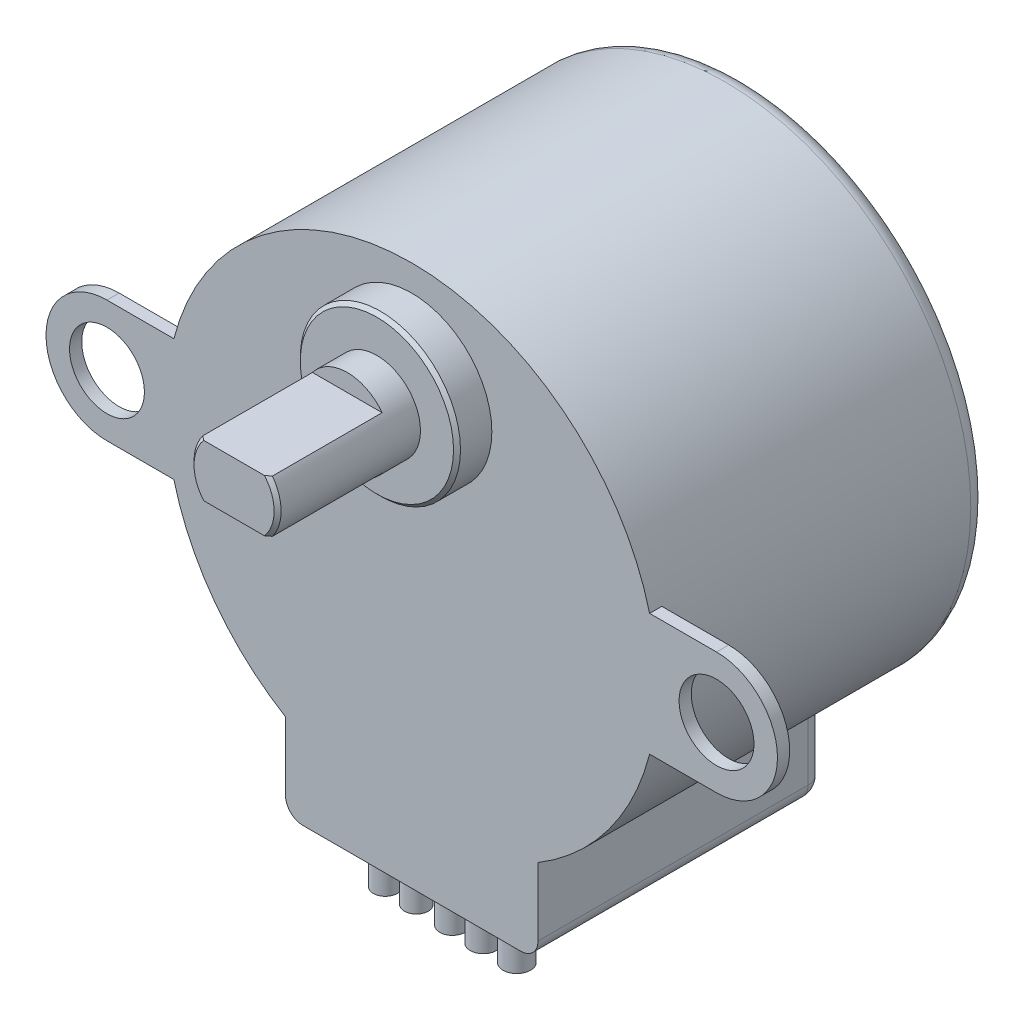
ISO-10303-21;
HEADER;
FILE_DESCRIPTION(('STEP AP214'),'2;1');
FILE_NAME('part.step','',(''),(''),'','','');
FILE_SCHEMA(('AUTOMOTIVE_DESIGN { 1 0 10303 214 1 1 1 1 }'));
ENDSEC;
DATA;
#1=APPLICATION_CONTEXT('core data for automotive mechanical design processes');
#2=APPLICATION_PROTOCOL_DEFINITION('international standard','automotive_design',2000,#1);
#3=PRODUCT_CONTEXT('',#1,'mechanical');
#4=PRODUCT('Part','Part','',(#3));
#5=PRODUCT_RELATED_PRODUCT_CATEGORY('part','',(#4));
#6=PRODUCT_DEFINITION_FORMATION('','',#4);
#7=PRODUCT_DEFINITION_CONTEXT('part definition',#1,'design');
#8=PRODUCT_DEFINITION('design','',#6,#7);
#9=PRODUCT_DEFINITION_SHAPE('','',#8);
#10=(LENGTH_UNIT() NAMED_UNIT(*) SI_UNIT(.MILLI.,.METRE.));
#11=(NAMED_UNIT(*) PLANE_ANGLE_UNIT() SI_UNIT($,.RADIAN.));
#12=(NAMED_UNIT(*) SI_UNIT($,.STERADIAN.) SOLID_ANGLE_UNIT());
#13=UNCERTAINTY_MEASURE_WITH_UNIT(LENGTH_MEASURE(1.E-05),#10,'distance_accuracy_value','');
#14=(GEOMETRIC_REPRESENTATION_CONTEXT(3) GLOBAL_UNCERTAINTY_ASSIGNED_CONTEXT((#13)) GLOBAL_UNIT_ASSIGNED_CONTEXT((#10,
#11,#12)) REPRESENTATION_CONTEXT('',''));
#15=CARTESIAN_POINT('',(0.,0.,0.));
#16=DIRECTION('',(0.,0.,1.));
#17=DIRECTION('',(1.,0.,0.));
#18=AXIS2_PLACEMENT_3D('',#15,#16,#17);
#19=CARTESIAN_POINT('',(0.,0.,19.));
#20=DIRECTION('',(0.,0.,-1.));
#21=DIRECTION('',(-1.,0.,0.));
#22=AXIS2_PLACEMENT_3D('',#19,#20,#21);
#23=CYLINDRICAL_SURFACE('',#22,14.1);
#24=CARTESIAN_POINT('',(0.,0.,19.));
#25=DIRECTION('',(0.,0.,1.));
#26=DIRECTION('',(1.,0.,0.));
#27=AXIS2_PLACEMENT_3D('',#24,#25,#26);
#28=CIRCLE('',#27,14.1);
#29=CARTESIAN_POINT('',(7.25,-12.0932832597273,19.));
#30=VERTEX_POINT('',#29);
#31=CARTESIAN_POINT('',(13.6586968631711,-3.5,19.));
#32=VERTEX_POINT('',#31);
#33=EDGE_CURVE('E210',#30,#32,#28,.T.);
#34=ORIENTED_EDGE('',*,*,#33,.F.);
#35=DIRECTION('',(0.,0.,1.));
#36=VECTOR('',#35,1.);
#37=CARTESIAN_POINT('',(7.25,-12.0932832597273,2.5));
#38=LINE('',#37,#36);
#39=CARTESIAN_POINT('',(7.25,-12.0932832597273,3.5));
#40=VERTEX_POINT('',#39);
#41=EDGE_CURVE('E191',#40,#30,#38,.T.);
#42=ORIENTED_EDGE('',*,*,#41,.F.);
#43=CARTESIAN_POINT('',(7.25,-12.0932832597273,3.5));
#44=CARTESIAN_POINT('',(7.25000168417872,-12.0932817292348,3.47459911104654));
#45=CARTESIAN_POINT('',(7.24903146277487,-12.0938639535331,3.44921177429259));
#46=CARTESIAN_POINT('',(7.24517330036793,-12.0961759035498,3.39864565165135));
#47=CARTESIAN_POINT('',(7.24228611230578,-12.0979051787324,3.3734667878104));
#48=CARTESIAN_POINT('',(7.23083007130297,-12.1047585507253,3.29876541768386));
#49=CARTESIAN_POINT('',(7.21946606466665,-12.1115486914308,3.24978931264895));
#50=CARTESIAN_POINT('',(7.18986225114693,-12.1291455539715,3.15484074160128));
#51=CARTESIAN_POINT('',(7.17163025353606,-12.1399477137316,3.10886493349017));
#52=CARTESIAN_POINT('',(7.1290701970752,-12.1649893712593,3.02080300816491));
#53=CARTESIAN_POINT('',(7.10473597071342,-12.1792323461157,2.9787208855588));
#54=CARTESIAN_POINT('',(7.04923346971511,-12.2114452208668,2.89682658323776));
#55=CARTESIAN_POINT('',(7.01774282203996,-12.2295874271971,2.85730197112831));
#56=CARTESIAN_POINT('',(6.94991243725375,-12.2682615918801,2.78402660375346));
#57=CARTESIAN_POINT('',(6.91357125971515,-12.2887942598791,2.75027757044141));
#58=CARTESIAN_POINT('',(6.83178892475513,-12.3344692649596,2.68475548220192));
#59=CARTESIAN_POINT('',(6.78578144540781,-12.3598598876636,2.65386201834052));
#60=CARTESIAN_POINT('',(6.6899080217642,-12.4120151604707,2.60027714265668));
#61=CARTESIAN_POINT('',(6.64003921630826,-12.4387808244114,2.5775918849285));
#62=CARTESIAN_POINT('',(6.53449257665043,-12.4945647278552,2.53958647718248));
#63=CARTESIAN_POINT('',(6.47864575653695,-12.5236216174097,2.52479145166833));
#64=CARTESIAN_POINT('',(6.36526848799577,-12.5816341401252,2.5049996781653));
#65=CARTESIAN_POINT('',(6.30773988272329,-12.6105898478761,2.49999258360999));
#66=CARTESIAN_POINT('',(6.25,-12.6391257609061,2.5));
#67=B_SPLINE_CURVE_WITH_KNOTS('',3,(#43,#44,#45,#46,#47,#48,#49,#50,#51,#52,#53,#54,#55,#56,#57,
#58,#59,#60,#61,#62,#63,#64,#65,#66),.UNSPECIFIED.,.F.,.F.,(4,2,2,2,2,2,2,2,2,2,2,4),(0.,
0.0761512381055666,0.152272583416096,0.303660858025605,0.454877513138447,0.606247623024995,
0.766697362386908,0.927194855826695,1.1093270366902,1.29159548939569,1.48482806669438,
1.67785627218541),.UNSPECIFIED.);
#68=CARTESIAN_POINT('',(6.25,-12.6391257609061,2.5));
#69=VERTEX_POINT('',#68);
#70=EDGE_CURVE('E45',#40,#69,#67,.T.);
#71=ORIENTED_EDGE('',*,*,#70,.T.);
#72=CARTESIAN_POINT('',(0.,0.,2.5));
#73=DIRECTION('',(0.,0.,-1.));
#74=DIRECTION('',(1.,0.,0.));
#75=AXIS2_PLACEMENT_3D('',#72,#73,#74);
#76=CIRCLE('',#75,14.1);
#77=CARTESIAN_POINT('',(-6.25,-12.6391257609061,2.5));
#78=VERTEX_POINT('',#77);
#79=EDGE_CURVE('E192',#69,#78,#76,.T.);
#80=ORIENTED_EDGE('',*,*,#79,.T.);
#81=CARTESIAN_POINT('',(-6.25,-12.6391257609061,2.5));
#82=CARTESIAN_POINT('',(-6.31273446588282,-12.6081259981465,2.49999247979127));
#83=CARTESIAN_POINT('',(-6.3752117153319,-12.5766285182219,2.50590226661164));
#84=CARTESIAN_POINT('',(-6.49810654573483,-12.5135623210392,2.52924825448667));
#85=CARTESIAN_POINT('',(-6.55851957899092,-12.4819935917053,2.54670837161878));
#86=CARTESIAN_POINT('',(-6.67550796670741,-12.4198239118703,2.59286061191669));
#87=CARTESIAN_POINT('',(-6.73208054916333,-12.3892236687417,2.6215607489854));
#88=CARTESIAN_POINT('',(-6.83956541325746,-12.3302105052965,2.68977855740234));
#89=CARTESIAN_POINT('',(-6.89048096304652,-12.3017963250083,2.72928993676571));
#90=CARTESIAN_POINT('',(-6.98267203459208,-12.2496930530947,2.8165922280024));
#91=CARTESIAN_POINT('',(-7.02426990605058,-12.2258524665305,2.86394966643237));
#92=CARTESIAN_POINT('',(-7.09855678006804,-12.1828706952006,2.96710484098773));
#93=CARTESIAN_POINT('',(-7.13125204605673,-12.1637262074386,3.02289659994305));
#94=CARTESIAN_POINT('',(-7.18216086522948,-12.1337268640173,3.13353777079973));
#95=CARTESIAN_POINT('',(-7.2017018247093,-12.12211937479,3.18757282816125));
#96=CARTESIAN_POINT('',(-7.23126870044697,-12.1045056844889,3.29898284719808));
#97=CARTESIAN_POINT('',(-7.24132376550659,-12.0984823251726,3.35634699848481));
#98=CARTESIAN_POINT('',(-7.24754151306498,-12.0947567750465,3.42845423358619));
#99=CARTESIAN_POINT('',(-7.24846346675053,-12.0942042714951,3.44275170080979));
#100=CARTESIAN_POINT('',(-7.24969164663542,-12.0934681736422,3.47136380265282));
#101=CARTESIAN_POINT('',(-7.24999867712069,-12.093284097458,3.48567839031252));
#102=CARTESIAN_POINT('',(-7.25,-12.0932832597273,3.5));
#103=B_SPLINE_CURVE_WITH_KNOTS('',3,(#81,#82,#83,#84,#85,#86,#87,#88,#89,#90,#91,#92,#93,#94,
#95,#96,#97,#98,#99,#100,#101,#102),.UNSPECIFIED.,.F.,.F.,(4,2,2,2,2,2,2,2,2,2,4),(0.,
0.209670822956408,0.419777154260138,0.630033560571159,0.840167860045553,1.04118736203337,
1.24206506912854,1.41691801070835,1.59123188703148,1.63423450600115,1.67718084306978),.UNSPECIFIED.);
#104=CARTESIAN_POINT('',(-7.25,-12.0932832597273,3.5));
#105=VERTEX_POINT('',#104);
#106=EDGE_CURVE('E11',#78,#105,#103,.T.);
#107=ORIENTED_EDGE('',*,*,#106,.T.);
#108=DIRECTION('',(0.,0.,1.));
#109=VECTOR('',#108,1.);
#110=CARTESIAN_POINT('',(-7.25,-12.0932832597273,2.5));
#111=LINE('',#110,#109);
#112=CARTESIAN_POINT('',(-7.25,-12.0932832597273,19.));
#113=VERTEX_POINT('',#112);
#114=EDGE_CURVE('E184',#105,#113,#111,.T.);
#115=ORIENTED_EDGE('',*,*,#114,.T.);
#116=CARTESIAN_POINT('',(-13.6586968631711,-3.5,19.));
#117=VERTEX_POINT('',#116);
#118=EDGE_CURVE('E190',#117,#113,#28,.T.);
#119=ORIENTED_EDGE('',*,*,#118,.F.);
#120=DIRECTION('',(0.,0.,-1.));
#121=VECTOR('',#120,1.);
#122=CARTESIAN_POINT('',(-13.6586968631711,-3.5,19.));
#123=LINE('',#122,#121);
#124=CARTESIAN_POINT('',(-13.6586968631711,-3.5,18.3));
#125=VERTEX_POINT('',#124);
#126=EDGE_CURVE('E479',#117,#125,#123,.T.);
#127=ORIENTED_EDGE('',*,*,#126,.T.);
#128=CARTESIAN_POINT('',(0.,0.,18.3));
#129=DIRECTION('',(0.,0.,1.));
#130=DIRECTION('',(1.,0.,0.));
#131=AXIS2_PLACEMENT_3D('',#128,#129,#130);
#132=CIRCLE('',#131,14.1);
#133=CARTESIAN_POINT('',(-13.6586968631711,3.5,18.3));
#134=VERTEX_POINT('',#133);
#135=EDGE_CURVE('E219',#134,#125,#132,.T.);
#136=ORIENTED_EDGE('',*,*,#135,.F.);
#137=DIRECTION('',(0.,0.,-1.));
#138=VECTOR('',#137,1.);
#139=CARTESIAN_POINT('',(-13.6586968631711,3.5,19.));
#140=LINE('',#139,#138);
#141=CARTESIAN_POINT('',(-13.6586968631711,3.5,19.));
#142=VERTEX_POINT('',#141);
#143=EDGE_CURVE('E480',#134,#142,#140,.F.);
#144=ORIENTED_EDGE('',*,*,#143,.T.);
#145=CARTESIAN_POINT('',(13.6586968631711,3.5,19.));
#146=VERTEX_POINT('',#145);
#147=EDGE_CURVE('E209',#146,#142,#28,.T.);
#148=ORIENTED_EDGE('',*,*,#147,.F.);
#149=DIRECTION('',(0.,0.,-1.));
#150=VECTOR('',#149,1.);
#151=CARTESIAN_POINT('',(13.6586968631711,3.5,19.));
#152=LINE('',#151,#150);
#153=CARTESIAN_POINT('',(13.6586968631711,3.5,18.3));
#154=VERTEX_POINT('',#153);
#155=EDGE_CURVE('E214',#146,#154,#152,.T.);
#156=ORIENTED_EDGE('',*,*,#155,.T.);
#157=CARTESIAN_POINT('',(13.6586968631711,-3.5,18.3));
#158=VERTEX_POINT('',#157);
#159=EDGE_CURVE('E213',#158,#154,#132,.T.);
#160=ORIENTED_EDGE('',*,*,#159,.F.);
#161=DIRECTION('',(0.,0.,-1.));
#162=VECTOR('',#161,1.);
#163=CARTESIAN_POINT('',(13.6586968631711,-3.5,19.));
#164=LINE('',#163,#162);
#165=EDGE_CURVE('E470',#158,#32,#164,.F.);
#166=ORIENTED_EDGE('',*,*,#165,.T.);
#167=EDGE_LOOP('',(#34,#42,#71,#80,#107,#115,#119,#127,#136,#144,#148,#156,#160,#166));
#168=FACE_BOUND('',#167,.T.);
#169=CARTESIAN_POINT('',(0.,0.,1.));
#170=DIRECTION('',(0.,0.,1.));
#171=DIRECTION('',(1.,0.,0.));
#172=AXIS2_PLACEMENT_3D('',#169,#170,#171);
#173=CIRCLE('',#172,14.1);
#174=CARTESIAN_POINT('',(14.1,0.,1.));
#175=VERTEX_POINT('',#174);
#176=EDGE_CURVE('E220',#175,#175,#173,.T.);
#177=ORIENTED_EDGE('',*,*,#176,.T.);
#178=EDGE_LOOP('',(#177));
#179=FACE_BOUND('',#178,.T.);
#180=ADVANCED_FACE('F35',(#168,#179),#23,.T.);
#181=CARTESIAN_POINT('',(0.,0.,19.));
#182=DIRECTION('',(0.,0.,1.));
#183=DIRECTION('',(1.,0.,0.));
#184=AXIS2_PLACEMENT_3D('',#181,#182,#183);
#185=PLANE('',#184);
#186=CARTESIAN_POINT('',(0.,8.,19.));
#187=DIRECTION('',(0.,0.,1.));
#188=DIRECTION('',(1.,0.,0.));
#189=AXIS2_PLACEMENT_3D('',#186,#187,#188);
#190=CIRCLE('',#189,4.6);
#191=CARTESIAN_POINT('',(4.6,8.,19.));
#192=VERTEX_POINT('',#191);
#193=EDGE_CURVE('E411',#192,#192,#190,.T.);
#194=ORIENTED_EDGE('',*,*,#193,.F.);
#195=EDGE_LOOP('',(#194));
#196=FACE_BOUND('',#195,.T.);
#197=DIRECTION('',(1.,0.,0.));
#198=VECTOR('',#197,1.);
#199=CARTESIAN_POINT('',(-7.25,-17.,19.));
#200=LINE('',#199,#198);
#201=CARTESIAN_POINT('',(-6.25,-17.,19.));
#202=VERTEX_POINT('',#201);
#203=CARTESIAN_POINT('',(6.25,-17.,19.));
#204=VERTEX_POINT('',#203);
#205=EDGE_CURVE('E200',#202,#204,#200,.T.);
#206=ORIENTED_EDGE('',*,*,#205,.T.);
#207=CARTESIAN_POINT('',(6.25,-16.,19.));
#208=DIRECTION('',(0.,0.,1.));
#209=DIRECTION('',(1.,0.,0.));
#210=AXIS2_PLACEMENT_3D('',#207,#208,#209);
#211=CIRCLE('',#210,1.);
#212=CARTESIAN_POINT('',(7.25,-16.,19.));
#213=VERTEX_POINT('',#212);
#214=EDGE_CURVE('E360',#204,#213,#211,.T.);
#215=ORIENTED_EDGE('',*,*,#214,.T.);
#216=DIRECTION('',(0.,1.,0.));
#217=VECTOR('',#216,1.);
#218=CARTESIAN_POINT('',(7.25,-12.0932832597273,19.));
#219=LINE('',#218,#217);
#220=EDGE_CURVE('E379',#213,#30,#219,.T.);
#221=ORIENTED_EDGE('',*,*,#220,.T.);
#222=ORIENTED_EDGE('',*,*,#33,.T.);
#223=DIRECTION('',(1.,0.,0.));
#224=VECTOR('',#223,1.);
#225=CARTESIAN_POINT('',(-17.5,-3.5,19.));
#226=LINE('',#225,#224);
#227=CARTESIAN_POINT('',(17.5,-3.5,19.));
#228=VERTEX_POINT('',#227);
#229=EDGE_CURVE('E460',#32,#228,#226,.T.);
#230=ORIENTED_EDGE('',*,*,#229,.T.);
#231=CARTESIAN_POINT('',(17.5,0.,19.));
#232=DIRECTION('',(0.,0.,1.));
#233=DIRECTION('',(1.,0.,0.));
#234=AXIS2_PLACEMENT_3D('',#231,#232,#233);
#235=CIRCLE('',#234,3.5);
#236=CARTESIAN_POINT('',(17.5,3.5,19.));
#237=VERTEX_POINT('',#236);
#238=EDGE_CURVE('E462',#228,#237,#235,.T.);
#239=ORIENTED_EDGE('',*,*,#238,.T.);
#240=DIRECTION('',(-1.,0.,0.));
#241=VECTOR('',#240,1.);
#242=CARTESIAN_POINT('',(-17.5,3.5,19.));
#243=LINE('',#242,#241);
#244=EDGE_CURVE('E447',#237,#146,#243,.T.);
#245=ORIENTED_EDGE('',*,*,#244,.T.);
#246=ORIENTED_EDGE('',*,*,#147,.T.);
#247=CARTESIAN_POINT('',(-17.5,3.5,19.));
#248=VERTEX_POINT('',#247);
#249=EDGE_CURVE('E465',#142,#248,#243,.T.);
#250=ORIENTED_EDGE('',*,*,#249,.T.);
#251=CARTESIAN_POINT('',(-17.5,0.,19.));
#252=DIRECTION('',(0.,0.,1.));
#253=DIRECTION('',(1.,0.,0.));
#254=AXIS2_PLACEMENT_3D('',#251,#252,#253);
#255=CIRCLE('',#254,3.5);
#256=CARTESIAN_POINT('',(-17.5,-3.5,19.));
#257=VERTEX_POINT('',#256);
#258=EDGE_CURVE('E440',#248,#257,#255,.T.);
#259=ORIENTED_EDGE('',*,*,#258,.T.);
#260=EDGE_CURVE('E207',#257,#117,#226,.T.);
#261=ORIENTED_EDGE('',*,*,#260,.T.);
#262=ORIENTED_EDGE('',*,*,#118,.T.);
#263=DIRECTION('',(0.,-1.,0.));
#264=VECTOR('',#263,1.);
#265=CARTESIAN_POINT('',(-7.25,-12.0932832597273,19.));
#266=LINE('',#265,#264);
#267=CARTESIAN_POINT('',(-7.25,-16.,19.));
#268=VERTEX_POINT('',#267);
#269=EDGE_CURVE('E195',#113,#268,#266,.T.);
#270=ORIENTED_EDGE('',*,*,#269,.T.);
#271=CARTESIAN_POINT('',(-6.25,-16.,19.));
#272=DIRECTION('',(0.,0.,1.));
#273=DIRECTION('',(1.,0.,0.));
#274=AXIS2_PLACEMENT_3D('',#271,#272,#273);
#275=CIRCLE('',#274,1.);
#276=EDGE_CURVE('E356',#268,#202,#275,.T.);
#277=ORIENTED_EDGE('',*,*,#276,.T.);
#278=EDGE_LOOP('',(#206,#215,#221,#222,#230,#239,#245,#246,#250,#259,#261,#262,#270,#277));
#279=FACE_BOUND('',#278,.T.);
#280=CARTESIAN_POINT('',(17.5,0.,19.));
#281=DIRECTION('',(0.,0.,1.));
#282=DIRECTION('',(-1.,0.,0.));
#283=AXIS2_PLACEMENT_3D('',#280,#281,#282);
#284=CIRCLE('',#283,2.15);
#285=CARTESIAN_POINT('',(15.35,0.,19.));
#286=VERTEX_POINT('',#285);
#287=EDGE_CURVE('E430',#286,#286,#284,.T.);
#288=ORIENTED_EDGE('',*,*,#287,.F.);
#289=EDGE_LOOP('',(#288));
#290=FACE_BOUND('',#289,.T.);
#291=CARTESIAN_POINT('',(-17.5,0.,19.));
#292=DIRECTION('',(0.,0.,1.));
#293=DIRECTION('',(1.,0.,0.));
#294=AXIS2_PLACEMENT_3D('',#291,#292,#293);
#295=CIRCLE('',#294,2.15);
#296=CARTESIAN_POINT('',(-15.35,0.,19.));
#297=VERTEX_POINT('',#296);
#298=EDGE_CURVE('E434',#297,#297,#295,.T.);
#299=ORIENTED_EDGE('',*,*,#298,.F.);
#300=EDGE_LOOP('',(#299));
#301=FACE_BOUND('',#300,.T.);
#302=ADVANCED_FACE('F203',(#196,#279,#290,#301),#185,.T.);
#303=CARTESIAN_POINT('',(0.,0.,0.));
#304=DIRECTION('',(0.,0.,1.));
#305=DIRECTION('',(1.,0.,0.));
#306=AXIS2_PLACEMENT_3D('',#303,#304,#305);
#307=PLANE('',#306);
#308=CARTESIAN_POINT('',(0.,0.,0.));
#309=DIRECTION('',(0.,0.,1.));
#310=DIRECTION('',(1.,0.,0.));
#311=AXIS2_PLACEMENT_3D('',#308,#309,#310);
#312=CIRCLE('',#311,13.1);
#313=CARTESIAN_POINT('',(13.1,0.,0.));
#314=VERTEX_POINT('',#313);
#315=EDGE_CURVE('E223',#314,#314,#312,.F.);
#316=ORIENTED_EDGE('',*,*,#315,.T.);
#317=EDGE_LOOP('',(#316));
#318=FACE_BOUND('',#317,.T.);
#319=ADVANCED_FACE('F309',(#318),#307,.F.);
#320=CARTESIAN_POINT('',(17.5,0.,18.3));
#321=DIRECTION('',(0.,0.,1.));
#322=DIRECTION('',(1.,0.,0.));
#323=AXIS2_PLACEMENT_3D('',#320,#321,#322);
#324=CYLINDRICAL_SURFACE('',#323,2.15);
#325=CARTESIAN_POINT('',(17.5,0.,18.3));
#326=DIRECTION('',(0.,0.,1.));
#327=DIRECTION('',(-1.,0.,0.));
#328=AXIS2_PLACEMENT_3D('',#325,#326,#327);
#329=CIRCLE('',#328,2.15);
#330=CARTESIAN_POINT('',(15.35,0.,18.3));
#331=VERTEX_POINT('',#330);
#332=EDGE_CURVE('E431',#331,#331,#329,.T.);
#333=ORIENTED_EDGE('',*,*,#332,.F.);
#334=EDGE_LOOP('',(#333));
#335=FACE_BOUND('',#334,.T.);
#336=ORIENTED_EDGE('',*,*,#287,.T.);
#337=EDGE_LOOP('',(#336));
#338=FACE_BOUND('',#337,.T.);
#339=ADVANCED_FACE('F834',(#335,#338),#324,.F.);
#340=CARTESIAN_POINT('',(17.5,0.,18.3));
#341=DIRECTION('',(0.,0.,1.));
#342=DIRECTION('',(1.,0.,0.));
#343=AXIS2_PLACEMENT_3D('',#340,#341,#342);
#344=CYLINDRICAL_SURFACE('',#343,3.5);
#345=ORIENTED_EDGE('',*,*,#238,.F.);
#346=DIRECTION('',(0.,0.,1.));
#347=VECTOR('',#346,1.);
#348=CARTESIAN_POINT('',(17.5,-3.5,18.3));
#349=LINE('',#348,#347);
#350=CARTESIAN_POINT('',(17.5,-3.5,18.3));
#351=VERTEX_POINT('',#350);
#352=EDGE_CURVE('E473',#351,#228,#349,.T.);
#353=ORIENTED_EDGE('',*,*,#352,.F.);
#354=CARTESIAN_POINT('',(17.5,0.,18.3));
#355=DIRECTION('',(0.,0.,1.));
#356=DIRECTION('',(1.,0.,0.));
#357=AXIS2_PLACEMENT_3D('',#354,#355,#356);
#358=CIRCLE('',#357,3.5);
#359=CARTESIAN_POINT('',(17.5,3.5,18.3));
#360=VERTEX_POINT('',#359);
#361=EDGE_CURVE('E451',#351,#360,#358,.T.);
#362=ORIENTED_EDGE('',*,*,#361,.T.);
#363=DIRECTION('',(0.,0.,1.));
#364=VECTOR('',#363,1.);
#365=CARTESIAN_POINT('',(17.5,3.5,18.3));
#366=LINE('',#365,#364);
#367=EDGE_CURVE('E471',#360,#237,#366,.T.);
#368=ORIENTED_EDGE('',*,*,#367,.T.);
#369=EDGE_LOOP('',(#345,#353,#362,#368));
#370=FACE_BOUND('',#369,.T.);
#371=ADVANCED_FACE('F501',(#370),#344,.T.);
#372=CARTESIAN_POINT('',(-17.5,0.,18.3));
#373=DIRECTION('',(0.,0.,1.));
#374=DIRECTION('',(1.,0.,0.));
#375=AXIS2_PLACEMENT_3D('',#372,#373,#374);
#376=PLANE('',#375);
#377=ORIENTED_EDGE('',*,*,#332,.T.);
#378=EDGE_LOOP('',(#377));
#379=FACE_BOUND('',#378,.T.);
#380=DIRECTION('',(1.,0.,0.));
#381=VECTOR('',#380,1.);
#382=CARTESIAN_POINT('',(-17.5,-3.5,18.3));
#383=LINE('',#382,#381);
#384=EDGE_CURVE('E446',#158,#351,#383,.T.);
#385=ORIENTED_EDGE('',*,*,#384,.F.);
#386=ORIENTED_EDGE('',*,*,#159,.T.);
#387=DIRECTION('',(-1.,0.,0.));
#388=VECTOR('',#387,1.);
#389=CARTESIAN_POINT('',(-17.5,3.5,18.3));
#390=LINE('',#389,#388);
#391=EDGE_CURVE('E455',#360,#154,#390,.T.);
#392=ORIENTED_EDGE('',*,*,#391,.F.);
#393=ORIENTED_EDGE('',*,*,#361,.F.);
#394=EDGE_LOOP('',(#385,#386,#392,#393));
#395=FACE_BOUND('',#394,.T.);
#396=ADVANCED_FACE('F494',(#379,#395),#376,.F.);
#397=CARTESIAN_POINT('',(-17.5,-3.5,18.3));
#398=DIRECTION('',(0.,-1.,0.));
#399=DIRECTION('',(0.,0.,-1.));
#400=AXIS2_PLACEMENT_3D('',#397,#398,#399);
#401=PLANE('',#400);
#402=ORIENTED_EDGE('',*,*,#165,.F.);
#403=ORIENTED_EDGE('',*,*,#384,.T.);
#404=ORIENTED_EDGE('',*,*,#352,.T.);
#405=ORIENTED_EDGE('',*,*,#229,.F.);
#406=EDGE_LOOP('',(#402,#403,#404,#405));
#407=FACE_BOUND('',#406,.T.);
#408=ADVANCED_FACE('F497',(#407),#401,.T.);
#409=CARTESIAN_POINT('',(-17.5,3.5,18.3));
#410=DIRECTION('',(0.,1.,0.));
#411=DIRECTION('',(0.,0.,1.));
#412=AXIS2_PLACEMENT_3D('',#409,#410,#411);
#413=PLANE('',#412);
#414=ORIENTED_EDGE('',*,*,#155,.F.);
#415=ORIENTED_EDGE('',*,*,#244,.F.);
#416=ORIENTED_EDGE('',*,*,#367,.F.);
#417=ORIENTED_EDGE('',*,*,#391,.T.);
#418=EDGE_LOOP('',(#414,#415,#416,#417));
#419=FACE_BOUND('',#418,.T.);
#420=ADVANCED_FACE('F489',(#419),#413,.T.);
#421=CARTESIAN_POINT('',(-17.5,0.,18.3));
#422=DIRECTION('',(0.,0.,1.));
#423=DIRECTION('',(1.,0.,0.));
#424=AXIS2_PLACEMENT_3D('',#421,#422,#423);
#425=CIRCLE('',#424,2.15);
#426=CARTESIAN_POINT('',(-15.35,0.,18.3));
#427=VERTEX_POINT('',#426);
#428=EDGE_CURVE('E437',#427,#427,#425,.T.);
#429=ORIENTED_EDGE('',*,*,#428,.T.);
#430=EDGE_LOOP('',(#429));
#431=FACE_BOUND('',#430,.T.);
#432=CARTESIAN_POINT('',(-17.5,3.5,18.3));
#433=VERTEX_POINT('',#432);
#434=EDGE_CURVE('E454',#134,#433,#390,.T.);
#435=ORIENTED_EDGE('',*,*,#434,.F.);
#436=ORIENTED_EDGE('',*,*,#135,.T.);
#437=CARTESIAN_POINT('',(-17.5,-3.5,18.3));
#438=VERTEX_POINT('',#437);
#439=EDGE_CURVE('E448',#438,#125,#383,.T.);
#440=ORIENTED_EDGE('',*,*,#439,.F.);
#441=CARTESIAN_POINT('',(-17.5,0.,18.3));
#442=DIRECTION('',(0.,0.,1.));
#443=DIRECTION('',(1.,0.,0.));
#444=AXIS2_PLACEMENT_3D('',#441,#442,#443);
#445=CIRCLE('',#444,3.5);
#446=EDGE_CURVE('E443',#433,#438,#445,.T.);
#447=ORIENTED_EDGE('',*,*,#446,.F.);
#448=EDGE_LOOP('',(#435,#436,#440,#447));
#449=FACE_BOUND('',#448,.T.);
#450=ADVANCED_FACE('F872',(#431,#449),#376,.F.);
#451=ORIENTED_EDGE('',*,*,#143,.F.);
#452=ORIENTED_EDGE('',*,*,#434,.T.);
#453=DIRECTION('',(0.,0.,1.));
#454=VECTOR('',#453,1.);
#455=CARTESIAN_POINT('',(-17.5,3.5,18.3));
#456=LINE('',#455,#454);
#457=EDGE_CURVE('E467',#433,#248,#456,.T.);
#458=ORIENTED_EDGE('',*,*,#457,.T.);
#459=ORIENTED_EDGE('',*,*,#249,.F.);
#460=EDGE_LOOP('',(#451,#452,#458,#459));
#461=FACE_BOUND('',#460,.T.);
#462=ADVANCED_FACE('F862',(#461),#413,.T.);
#463=ORIENTED_EDGE('',*,*,#126,.F.);
#464=ORIENTED_EDGE('',*,*,#260,.F.);
#465=DIRECTION('',(0.,0.,1.));
#466=VECTOR('',#465,1.);
#467=CARTESIAN_POINT('',(-17.5,-3.5,18.3));
#468=LINE('',#467,#466);
#469=EDGE_CURVE('E458',#438,#257,#468,.T.);
#470=ORIENTED_EDGE('',*,*,#469,.F.);
#471=ORIENTED_EDGE('',*,*,#439,.T.);
#472=EDGE_LOOP('',(#463,#464,#470,#471));
#473=FACE_BOUND('',#472,.T.);
#474=ADVANCED_FACE('F852',(#473),#401,.T.);
#475=CARTESIAN_POINT('',(-17.5,0.,18.3));
#476=DIRECTION('',(0.,0.,1.));
#477=DIRECTION('',(1.,0.,0.));
#478=AXIS2_PLACEMENT_3D('',#475,#476,#477);
#479=CYLINDRICAL_SURFACE('',#478,3.5);
#480=ORIENTED_EDGE('',*,*,#258,.F.);
#481=ORIENTED_EDGE('',*,*,#457,.F.);
#482=ORIENTED_EDGE('',*,*,#446,.T.);
#483=ORIENTED_EDGE('',*,*,#469,.T.);
#484=EDGE_LOOP('',(#480,#481,#482,#483));
#485=FACE_BOUND('',#484,.T.);
#486=ADVANCED_FACE('F842',(#485),#479,.T.);
#487=CARTESIAN_POINT('',(-17.5,0.,18.3));
#488=DIRECTION('',(0.,0.,1.));
#489=DIRECTION('',(1.,0.,0.));
#490=AXIS2_PLACEMENT_3D('',#487,#488,#489);
#491=CYLINDRICAL_SURFACE('',#490,2.15);
#492=ORIENTED_EDGE('',*,*,#428,.F.);
#493=EDGE_LOOP('',(#492));
#494=FACE_BOUND('',#493,.T.);
#495=ORIENTED_EDGE('',*,*,#298,.T.);
#496=EDGE_LOOP('',(#495));
#497=FACE_BOUND('',#496,.T.);
#498=ADVANCED_FACE('F304',(#494,#497),#491,.F.);
#499=CARTESIAN_POINT('',(0.,0.,1.));
#500=DIRECTION('',(0.,0.,1.));
#501=DIRECTION('',(1.,0.,0.));
#502=AXIS2_PLACEMENT_3D('',#499,#500,#501);
#503=TOROIDAL_SURFACE('',#502,13.1,1.);
#504=ORIENTED_EDGE('',*,*,#315,.F.);
#505=EDGE_LOOP('',(#504));
#506=FACE_BOUND('',#505,.T.);
#507=ORIENTED_EDGE('',*,*,#176,.F.);
#508=EDGE_LOOP('',(#507));
#509=FACE_BOUND('',#508,.T.);
#510=ADVANCED_FACE('F300',(#506,#509),#503,.T.);
#511=CARTESIAN_POINT('',(0.,8.,21.));
#512=DIRECTION('',(0.,0.,-1.));
#513=DIRECTION('',(-1.,0.,0.));
#514=AXIS2_PLACEMENT_3D('',#511,#512,#513);
#515=CYLINDRICAL_SURFACE('',#514,4.6);
#516=CARTESIAN_POINT('',(0.,8.,20.8));
#517=DIRECTION('',(0.,0.,1.));
#518=DIRECTION('',(1.,0.,0.));
#519=AXIS2_PLACEMENT_3D('',#516,#517,#518);
#520=CIRCLE('',#519,4.6);
#521=CARTESIAN_POINT('',(4.6,8.,20.8));
#522=VERTEX_POINT('',#521);
#523=EDGE_CURVE('E230',#522,#522,#520,.F.);
#524=ORIENTED_EDGE('',*,*,#523,.T.);
#525=EDGE_LOOP('',(#524));
#526=FACE_BOUND('',#525,.T.);
#527=ORIENTED_EDGE('',*,*,#193,.T.);
#528=EDGE_LOOP('',(#527));
#529=FACE_BOUND('',#528,.T.);
#530=ADVANCED_FACE('F303',(#526,#529),#515,.T.);
#531=CARTESIAN_POINT('',(0.,8.,21.));
#532=DIRECTION('',(0.,0.,1.));
#533=DIRECTION('',(1.,0.,0.));
#534=AXIS2_PLACEMENT_3D('',#531,#532,#533);
#535=PLANE('',#534);
#536=CARTESIAN_POINT('',(0.,8.,21.));
#537=DIRECTION('',(0.,0.,1.));
#538=DIRECTION('',(1.,0.,0.));
#539=AXIS2_PLACEMENT_3D('',#536,#537,#538);
#540=CIRCLE('',#539,4.4);
#541=CARTESIAN_POINT('',(4.4,8.,21.));
#542=VERTEX_POINT('',#541);
#543=EDGE_CURVE('E227',#542,#542,#540,.T.);
#544=ORIENTED_EDGE('',*,*,#543,.T.);
#545=EDGE_LOOP('',(#544));
#546=FACE_BOUND('',#545,.T.);
#547=CARTESIAN_POINT('',(0.,8.,21.));
#548=DIRECTION('',(0.,0.,1.));
#549=DIRECTION('',(1.,0.,0.));
#550=AXIS2_PLACEMENT_3D('',#547,#548,#549);
#551=CIRCLE('',#550,2.5);
#552=CARTESIAN_POINT('',(2.5,8.,21.));
#553=VERTEX_POINT('',#552);
#554=EDGE_CURVE('E226',#553,#553,#551,.T.);
#555=ORIENTED_EDGE('',*,*,#554,.F.);
#556=EDGE_LOOP('',(#555));
#557=FACE_BOUND('',#556,.T.);
#558=ADVANCED_FACE('F789',(#546,#557),#535,.T.);
#559=CARTESIAN_POINT('',(0.,8.,29.2));
#560=DIRECTION('',(0.,0.,-1.));
#561=DIRECTION('',(-1.,0.,0.));
#562=AXIS2_PLACEMENT_3D('',#559,#560,#561);
#563=CYLINDRICAL_SURFACE('',#562,2.5);
#564=DIRECTION('',(0.,0.,1.));
#565=VECTOR('',#564,1.);
#566=CARTESIAN_POINT('',(2.,9.5,22.7));
#567=LINE('',#566,#565);
#568=CARTESIAN_POINT('',(2.,9.5,22.7));
#569=VERTEX_POINT('',#568);
#570=CARTESIAN_POINT('',(2.,9.5,29.));
#571=VERTEX_POINT('',#570);
#572=EDGE_CURVE('E408',#569,#571,#567,.T.);
#573=ORIENTED_EDGE('',*,*,#572,.T.);
#574=CARTESIAN_POINT('',(0.,8.,29.));
#575=DIRECTION('',(0.,0.,1.));
#576=DIRECTION('',(1.,0.,0.));
#577=AXIS2_PLACEMENT_3D('',#574,#575,#576);
#578=CIRCLE('',#577,2.5);
#579=CARTESIAN_POINT('',(2.,6.5,29.));
#580=VERTEX_POINT('',#579);
#581=EDGE_CURVE('E952',#571,#580,#578,.F.);
#582=ORIENTED_EDGE('',*,*,#581,.T.);
#583=DIRECTION('',(0.,0.,1.));
#584=VECTOR('',#583,1.);
#585=CARTESIAN_POINT('',(2.,6.5,22.7));
#586=LINE('',#585,#584);
#587=CARTESIAN_POINT('',(2.,6.5,22.7));
#588=VERTEX_POINT('',#587);
#589=EDGE_CURVE('E419',#588,#580,#586,.T.);
#590=ORIENTED_EDGE('',*,*,#589,.F.);
#591=CARTESIAN_POINT('',(0.,8.,22.7));
#592=DIRECTION('',(0.,0.,1.));
#593=DIRECTION('',(1.,0.,0.));
#594=AXIS2_PLACEMENT_3D('',#591,#592,#593);
#595=CIRCLE('',#594,2.5);
#596=CARTESIAN_POINT('',(-2.,6.5,22.7));
#597=VERTEX_POINT('',#596);
#598=EDGE_CURVE('E414',#597,#588,#595,.T.);
#599=ORIENTED_EDGE('',*,*,#598,.F.);
#600=DIRECTION('',(0.,0.,1.));
#601=VECTOR('',#600,1.);
#602=CARTESIAN_POINT('',(-2.,6.5,22.7));
#603=LINE('',#602,#601);
#604=CARTESIAN_POINT('',(-2.,6.5,29.));
#605=VERTEX_POINT('',#604);
#606=EDGE_CURVE('E407',#597,#605,#603,.T.);
#607=ORIENTED_EDGE('',*,*,#606,.T.);
#608=CARTESIAN_POINT('',(0.,8.,29.));
#609=DIRECTION('',(0.,0.,1.));
#610=DIRECTION('',(1.,0.,0.));
#611=AXIS2_PLACEMENT_3D('',#608,#609,#610);
#612=CIRCLE('',#611,2.5);
#613=CARTESIAN_POINT('',(-2.,9.5,29.));
#614=VERTEX_POINT('',#613);
#615=EDGE_CURVE('E950',#605,#614,#612,.F.);
#616=ORIENTED_EDGE('',*,*,#615,.T.);
#617=DIRECTION('',(0.,0.,1.));
#618=VECTOR('',#617,1.);
#619=CARTESIAN_POINT('',(-2.,9.5,22.7));
#620=LINE('',#619,#618);
#621=CARTESIAN_POINT('',(-2.,9.5,22.7));
#622=VERTEX_POINT('',#621);
#623=EDGE_CURVE('E404',#622,#614,#620,.T.);
#624=ORIENTED_EDGE('',*,*,#623,.F.);
#625=CARTESIAN_POINT('',(0.,8.,22.7));
#626=DIRECTION('',(0.,0.,1.));
#627=DIRECTION('',(1.,0.,0.));
#628=AXIS2_PLACEMENT_3D('',#625,#626,#627);
#629=CIRCLE('',#628,2.5);
#630=EDGE_CURVE('E398',#569,#622,#629,.T.);
#631=ORIENTED_EDGE('',*,*,#630,.F.);
#632=EDGE_LOOP('',(#573,#582,#590,#599,#607,#616,#624,#631));
#633=FACE_BOUND('',#632,.T.);
#634=ORIENTED_EDGE('',*,*,#554,.T.);
#635=EDGE_LOOP('',(#634));
#636=FACE_BOUND('',#635,.T.);
#637=ADVANCED_FACE('F780',(#633,#636),#563,.T.);
#638=CARTESIAN_POINT('',(0.,8.,29.2));
#639=DIRECTION('',(0.,0.,1.));
#640=DIRECTION('',(1.,0.,0.));
#641=AXIS2_PLACEMENT_3D('',#638,#639,#640);
#642=PLANE('',#641);
#643=DIRECTION('',(-1.,0.,0.));
#644=VECTOR('',#643,1.);
#645=CARTESIAN_POINT('',(-2.,6.5,29.2));
#646=LINE('',#645,#644);
#647=CARTESIAN_POINT('',(1.74355957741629,6.5,29.2));
#648=VERTEX_POINT('',#647);
#649=CARTESIAN_POINT('',(-1.74355957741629,6.5,29.2));
#650=VERTEX_POINT('',#649);
#651=EDGE_CURVE('E396',#648,#650,#646,.T.);
#652=ORIENTED_EDGE('',*,*,#651,.F.);
#653=CARTESIAN_POINT('',(0.,8.,29.2));
#654=DIRECTION('',(0.,0.,1.));
#655=DIRECTION('',(1.,0.,0.));
#656=AXIS2_PLACEMENT_3D('',#653,#654,#655);
#657=CIRCLE('',#656,2.30000000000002);
#658=CARTESIAN_POINT('',(1.74355957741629,9.5,29.2));
#659=VERTEX_POINT('',#658);
#660=EDGE_CURVE('E236',#648,#659,#657,.T.);
#661=ORIENTED_EDGE('',*,*,#660,.T.);
#662=DIRECTION('',(1.,0.,0.));
#663=VECTOR('',#662,1.);
#664=CARTESIAN_POINT('',(-2.,9.5,29.2));
#665=LINE('',#664,#663);
#666=CARTESIAN_POINT('',(-1.74355957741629,9.5,29.2));
#667=VERTEX_POINT('',#666);
#668=EDGE_CURVE('E401',#667,#659,#665,.T.);
#669=ORIENTED_EDGE('',*,*,#668,.F.);
#670=CARTESIAN_POINT('',(0.,8.,29.2));
#671=DIRECTION('',(0.,0.,1.));
#672=DIRECTION('',(1.,0.,0.));
#673=AXIS2_PLACEMENT_3D('',#670,#671,#672);
#674=CIRCLE('',#673,2.30000000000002);
#675=EDGE_CURVE('E233',#667,#650,#674,.T.);
#676=ORIENTED_EDGE('',*,*,#675,.T.);
#677=EDGE_LOOP('',(#652,#661,#669,#676));
#678=FACE_BOUND('',#677,.T.);
#679=ADVANCED_FACE('F272',(#678),#642,.T.);
#680=CARTESIAN_POINT('',(-2.,6.5,22.7));
#681=DIRECTION('',(0.,1.,0.));
#682=DIRECTION('',(0.,0.,1.));
#683=AXIS2_PLACEMENT_3D('',#680,#681,#682);
#684=PLANE('',#683);
#685=ORIENTED_EDGE('',*,*,#589,.T.);
#686=CARTESIAN_POINT('',(2.,6.5,29.));
#687=CARTESIAN_POINT('',(1.95769380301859,6.5,29.0338894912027));
#688=CARTESIAN_POINT('',(1.91517070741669,6.5,29.0675008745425));
#689=CARTESIAN_POINT('',(1.8296905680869,6.5,29.1341675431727));
#690=CARTESIAN_POINT('',(1.78673352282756,6.5,29.1672228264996));
#691=CARTESIAN_POINT('',(1.74355957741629,6.5,29.2));
#692=B_SPLINE_CURVE_WITH_KNOTS('',3,(#686,#687,#688,#689,#690,#691),.UNSPECIFIED.,.F.,.F.,(4,2,
4),(0.,0.162608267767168,0.325217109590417),.UNSPECIFIED.);
#693=EDGE_CURVE('E283',#580,#648,#692,.T.);
#694=ORIENTED_EDGE('',*,*,#693,.T.);
#695=ORIENTED_EDGE('',*,*,#651,.T.);
#696=CARTESIAN_POINT('',(-1.74355957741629,6.5,29.2));
#697=CARTESIAN_POINT('',(-1.78673352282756,6.5,29.1672228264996));
#698=CARTESIAN_POINT('',(-1.8296905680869,6.5,29.1341675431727));
#699=CARTESIAN_POINT('',(-1.9151707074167,6.5,29.0675008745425));
#700=CARTESIAN_POINT('',(-1.95769380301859,6.5,29.0338894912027));
#701=CARTESIAN_POINT('',(-2.,6.5,29.));
#702=B_SPLINE_CURVE_WITH_KNOTS('',3,(#696,#697,#698,#699,#700,#701),.UNSPECIFIED.,.F.,.F.,(4,2,
4),(0.,0.162608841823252,0.325217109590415),.UNSPECIFIED.);
#703=EDGE_CURVE('E277',#650,#605,#702,.T.);
#704=ORIENTED_EDGE('',*,*,#703,.T.);
#705=ORIENTED_EDGE('',*,*,#606,.F.);
#706=DIRECTION('',(-1.,0.,0.));
#707=VECTOR('',#706,1.);
#708=CARTESIAN_POINT('',(-2.,6.5,22.7));
#709=LINE('',#708,#707);
#710=EDGE_CURVE('E416',#588,#597,#709,.T.);
#711=ORIENTED_EDGE('',*,*,#710,.F.);
#712=EDGE_LOOP('',(#685,#694,#695,#704,#705,#711));
#713=FACE_BOUND('',#712,.T.);
#714=ADVANCED_FACE('F267',(#713),#684,.F.);
#715=CARTESIAN_POINT('',(0.,8.,22.7));
#716=DIRECTION('',(0.,0.,1.));
#717=DIRECTION('',(1.,0.,0.));
#718=AXIS2_PLACEMENT_3D('',#715,#716,#717);
#719=PLANE('',#718);
#720=ORIENTED_EDGE('',*,*,#598,.T.);
#721=ORIENTED_EDGE('',*,*,#710,.T.);
#722=EDGE_LOOP('',(#720,#721));
#723=FACE_BOUND('',#722,.T.);
#724=ADVANCED_FACE('F261',(#723),#719,.T.);
#725=CARTESIAN_POINT('',(-2.,9.5,22.7));
#726=DIRECTION('',(0.,-1.,0.));
#727=DIRECTION('',(0.,0.,-1.));
#728=AXIS2_PLACEMENT_3D('',#725,#726,#727);
#729=PLANE('',#728);
#730=ORIENTED_EDGE('',*,*,#668,.T.);
#731=CARTESIAN_POINT('',(1.74355957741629,9.5,29.2));
#732=CARTESIAN_POINT('',(1.78673352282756,9.5,29.1672228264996));
#733=CARTESIAN_POINT('',(1.8296905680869,9.5,29.1341675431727));
#734=CARTESIAN_POINT('',(1.9151707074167,9.5,29.0675008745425));
#735=CARTESIAN_POINT('',(1.95769380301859,9.5,29.0338894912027));
#736=CARTESIAN_POINT('',(2.,9.5,29.));
#737=B_SPLINE_CURVE_WITH_KNOTS('',3,(#731,#732,#733,#734,#735,#736),.UNSPECIFIED.,.F.,.F.,(4,2,
4),(0.,0.162608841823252,0.325217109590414),.UNSPECIFIED.);
#738=EDGE_CURVE('E246',#659,#571,#737,.T.);
#739=ORIENTED_EDGE('',*,*,#738,.T.);
#740=ORIENTED_EDGE('',*,*,#572,.F.);
#741=DIRECTION('',(1.,0.,0.));
#742=VECTOR('',#741,1.);
#743=CARTESIAN_POINT('',(-2.,9.5,22.7));
#744=LINE('',#743,#742);
#745=EDGE_CURVE('E400',#622,#569,#744,.T.);
#746=ORIENTED_EDGE('',*,*,#745,.F.);
#747=ORIENTED_EDGE('',*,*,#623,.T.);
#748=CARTESIAN_POINT('',(-2.,9.5,29.));
#749=CARTESIAN_POINT('',(-1.95769380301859,9.5,29.0338894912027));
#750=CARTESIAN_POINT('',(-1.91517070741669,9.5,29.0675008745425));
#751=CARTESIAN_POINT('',(-1.8296905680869,9.5,29.1341675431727));
#752=CARTESIAN_POINT('',(-1.78673352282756,9.5,29.1672228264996));
#753=CARTESIAN_POINT('',(-1.74355957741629,9.5,29.2));
#754=B_SPLINE_CURVE_WITH_KNOTS('',3,(#748,#749,#750,#751,#752,#753),.UNSPECIFIED.,.F.,.F.,(4,2,
4),(0.,0.162608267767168,0.325217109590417),.UNSPECIFIED.);
#755=EDGE_CURVE('E239',#614,#667,#754,.T.);
#756=ORIENTED_EDGE('',*,*,#755,.T.);
#757=EDGE_LOOP('',(#730,#739,#740,#746,#747,#756));
#758=FACE_BOUND('',#757,.T.);
#759=ADVANCED_FACE('F255',(#758),#729,.F.);
#760=CARTESIAN_POINT('',(0.,8.,22.7));
#761=DIRECTION('',(0.,0.,1.));
#762=DIRECTION('',(1.,0.,0.));
#763=AXIS2_PLACEMENT_3D('',#760,#761,#762);
#764=PLANE('',#763);
#765=ORIENTED_EDGE('',*,*,#630,.T.);
#766=ORIENTED_EDGE('',*,*,#745,.T.);
#767=EDGE_LOOP('',(#765,#766));
#768=FACE_BOUND('',#767,.T.);
#769=ADVANCED_FACE('F260',(#768),#764,.T.);
#770=CARTESIAN_POINT('',(0.,8.,21.));
#771=DIRECTION('',(0.,0.,-1.));
#772=DIRECTION('',(-1.,0.,0.));
#773=AXIS2_PLACEMENT_3D('',#770,#771,#772);
#774=CONICAL_SURFACE('',#773,4.4,0.785398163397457);
#775=ORIENTED_EDGE('',*,*,#523,.F.);
#776=EDGE_LOOP('',(#775));
#777=FACE_BOUND('',#776,.T.);
#778=ORIENTED_EDGE('',*,*,#543,.F.);
#779=EDGE_LOOP('',(#778));
#780=FACE_BOUND('',#779,.T.);
#781=ADVANCED_FACE('F294',(#777,#780),#774,.T.);
#782=CARTESIAN_POINT('',(0.,8.,29.2));
#783=DIRECTION('',(0.,0.,-1.));
#784=DIRECTION('',(-1.,0.,0.));
#785=AXIS2_PLACEMENT_3D('',#782,#783,#784);
#786=CONICAL_SURFACE('',#785,2.30000000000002,0.785398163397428);
#787=ORIENTED_EDGE('',*,*,#693,.F.);
#788=ORIENTED_EDGE('',*,*,#581,.F.);
#789=ORIENTED_EDGE('',*,*,#738,.F.);
#790=ORIENTED_EDGE('',*,*,#660,.F.);
#791=EDGE_LOOP('',(#787,#788,#789,#790));
#792=FACE_BOUND('',#791,.T.);
#793=ADVANCED_FACE('F290',(#792),#786,.T.);
#794=CARTESIAN_POINT('',(0.,8.,29.2));
#795=DIRECTION('',(0.,0.,-1.));
#796=DIRECTION('',(-1.,0.,0.));
#797=AXIS2_PLACEMENT_3D('',#794,#795,#796);
#798=CONICAL_SURFACE('',#797,2.30000000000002,0.785398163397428);
#799=ORIENTED_EDGE('',*,*,#755,.F.);
#800=ORIENTED_EDGE('',*,*,#615,.F.);
#801=ORIENTED_EDGE('',*,*,#703,.F.);
#802=ORIENTED_EDGE('',*,*,#675,.F.);
#803=EDGE_LOOP('',(#799,#800,#801,#802));
#804=FACE_BOUND('',#803,.T.);
#805=ADVANCED_FACE('F252',(#804),#798,.T.);
#806=CARTESIAN_POINT('',(7.25,-12.0932832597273,2.5));
#807=DIRECTION('',(1.,0.,0.));
#808=DIRECTION('',(0.,1.,0.));
#809=AXIS2_PLACEMENT_3D('',#806,#807,#808);
#810=PLANE('',#809);
#811=ORIENTED_EDGE('',*,*,#220,.F.);
#812=DIRECTION('',(0.,0.,1.));
#813=VECTOR('',#812,1.);
#814=CARTESIAN_POINT('',(7.25,-16.,2.5));
#815=LINE('',#814,#813);
#816=CARTESIAN_POINT('',(7.25,-16.,3.5));
#817=VERTEX_POINT('',#816);
#818=EDGE_CURVE('E364',#213,#817,#815,.F.);
#819=ORIENTED_EDGE('',*,*,#818,.T.);
#820=DIRECTION('',(0.,1.,0.));
#821=VECTOR('',#820,1.);
#822=CARTESIAN_POINT('',(7.25,-12.0932832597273,3.5));
#823=LINE('',#822,#821);
#824=EDGE_CURVE('E362',#817,#40,#823,.T.);
#825=ORIENTED_EDGE('',*,*,#824,.T.);
#826=ORIENTED_EDGE('',*,*,#41,.T.);
#827=EDGE_LOOP('',(#811,#819,#825,#826));
#828=FACE_BOUND('',#827,.T.);
#829=ADVANCED_FACE('F503',(#828),#810,.T.);
#830=CARTESIAN_POINT('',(-7.25,-17.,2.5));
#831=DIRECTION('',(0.,-1.,0.));
#832=DIRECTION('',(1.,0.,0.));
#833=AXIS2_PLACEMENT_3D('',#830,#831,#832);
#834=PLANE('',#833);
#835=CARTESIAN_POINT('',(3.7015034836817,-17.,16.6670733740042));
#836=DIRECTION('',(0.,-1.,0.));
#837=DIRECTION('',(1.,0.,0.));
#838=AXIS2_PLACEMENT_3D('',#835,#836,#837);
#839=CIRCLE('',#838,0.788430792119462);
#840=CARTESIAN_POINT('',(4.48993427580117,-17.,16.6670733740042));
#841=VERTEX_POINT('',#840);
#842=EDGE_CURVE('E589',#841,#841,#839,.T.);
#843=ORIENTED_EDGE('',*,*,#842,.F.);
#844=EDGE_LOOP('',(#843));
#845=FACE_BOUND('',#844,.T.);
#846=CARTESIAN_POINT('',(1.77864453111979,-17.,16.6670733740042));
#847=DIRECTION('',(0.,-1.,0.));
#848=DIRECTION('',(1.,0.,0.));
#849=AXIS2_PLACEMENT_3D('',#846,#847,#848);
#850=CIRCLE('',#849,0.752437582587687);
#851=CARTESIAN_POINT('',(2.53108211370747,-17.,16.6670733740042));
#852=VERTEX_POINT('',#851);
#853=EDGE_CURVE('E588',#852,#852,#850,.T.);
#854=ORIENTED_EDGE('',*,*,#853,.F.);
#855=EDGE_LOOP('',(#854));
#856=FACE_BOUND('',#855,.T.);
#857=CARTESIAN_POINT('',(0.,-17.,16.6670733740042));
#858=DIRECTION('',(0.,-1.,0.));
#859=DIRECTION('',(1.,0.,0.));
#860=AXIS2_PLACEMENT_3D('',#857,#858,#859);
#861=CIRCLE('',#860,0.721072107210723);
#862=CARTESIAN_POINT('',(0.721072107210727,-17.,16.6670733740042));
#863=VERTEX_POINT('',#862);
#864=EDGE_CURVE('E598',#863,#863,#861,.T.);
#865=ORIENTED_EDGE('',*,*,#864,.F.);
#866=EDGE_LOOP('',(#865));
#867=FACE_BOUND('',#866,.T.);
#868=CARTESIAN_POINT('',(-2.06707337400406,-17.,16.6670733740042));
#869=DIRECTION('',(0.,-1.,0.));
#870=DIRECTION('',(1.,0.,0.));
#871=AXIS2_PLACEMENT_3D('',#868,#869,#870);
#872=CIRCLE('',#871,0.683224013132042);
#873=CARTESIAN_POINT('',(-1.38384936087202,-17.,16.6670733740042));
#874=VERTEX_POINT('',#873);
#875=EDGE_CURVE('E603',#874,#874,#872,.T.);
#876=ORIENTED_EDGE('',*,*,#875,.F.);
#877=EDGE_LOOP('',(#876));
#878=FACE_BOUND('',#877,.T.);
#879=CARTESIAN_POINT('',(-3.84571790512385,-17.,16.6670733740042));
#880=DIRECTION('',(0.,-1.,0.));
#881=DIRECTION('',(1.,0.,0.));
#882=AXIS2_PLACEMENT_3D('',#879,#880,#881);
#883=CIRCLE('',#882,0.693296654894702);
#884=CARTESIAN_POINT('',(-3.15242125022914,-17.,16.6670733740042));
#885=VERTEX_POINT('',#884);
#886=EDGE_CURVE('E609',#885,#885,#883,.T.);
#887=ORIENTED_EDGE('',*,*,#886,.F.);
#888=EDGE_LOOP('',(#887));
#889=FACE_BOUND('',#888,.T.);
#890=DIRECTION('',(1.,0.,0.));
#891=VECTOR('',#890,1.);
#892=CARTESIAN_POINT('',(7.25,-17.,3.5));
#893=LINE('',#892,#891);
#894=CARTESIAN_POINT('',(-6.25,-17.,3.5));
#895=VERTEX_POINT('',#894);
#896=CARTESIAN_POINT('',(6.25,-17.,3.5));
#897=VERTEX_POINT('',#896);
#898=EDGE_CURVE('E351',#895,#897,#893,.T.);
#899=ORIENTED_EDGE('',*,*,#898,.T.);
#900=DIRECTION('',(0.,0.,1.));
#901=VECTOR('',#900,1.);
#902=CARTESIAN_POINT('',(6.25,-17.,2.5));
#903=LINE('',#902,#901);
#904=EDGE_CURVE('E355',#897,#204,#903,.T.);
#905=ORIENTED_EDGE('',*,*,#904,.T.);
#906=ORIENTED_EDGE('',*,*,#205,.F.);
#907=DIRECTION('',(0.,0.,1.));
#908=VECTOR('',#907,1.);
#909=CARTESIAN_POINT('',(-6.25,-17.,2.5));
#910=LINE('',#909,#908);
#911=EDGE_CURVE('E288',#202,#895,#910,.F.);
#912=ORIENTED_EDGE('',*,*,#911,.T.);
#913=EDGE_LOOP('',(#899,#905,#906,#912));
#914=FACE_BOUND('',#913,.T.);
#915=ADVANCED_FACE('F389',(#845,#856,#867,#878,#889,#914),#834,.T.);
#916=CARTESIAN_POINT('',(-7.25,-12.0932832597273,2.5));
#917=DIRECTION('',(-1.,0.,0.));
#918=DIRECTION('',(0.,-1.,0.));
#919=AXIS2_PLACEMENT_3D('',#916,#917,#918);
#920=PLANE('',#919);
#921=DIRECTION('',(0.,-1.,0.));
#922=VECTOR('',#921,1.);
#923=CARTESIAN_POINT('',(-7.25,-17.,3.5));
#924=LINE('',#923,#922);
#925=CARTESIAN_POINT('',(-7.25,-16.,3.5));
#926=VERTEX_POINT('',#925);
#927=EDGE_CURVE('E53',#105,#926,#924,.T.);
#928=ORIENTED_EDGE('',*,*,#927,.T.);
#929=DIRECTION('',(0.,0.,1.));
#930=VECTOR('',#929,1.);
#931=CARTESIAN_POINT('',(-7.25,-16.,2.5));
#932=LINE('',#931,#930);
#933=EDGE_CURVE('E197',#926,#268,#932,.T.);
#934=ORIENTED_EDGE('',*,*,#933,.T.);
#935=ORIENTED_EDGE('',*,*,#269,.F.);
#936=ORIENTED_EDGE('',*,*,#114,.F.);
#937=EDGE_LOOP('',(#928,#934,#935,#936));
#938=FACE_BOUND('',#937,.T.);
#939=ADVANCED_FACE('F196',(#938),#920,.T.);
#940=CARTESIAN_POINT('',(0.,0.,2.5));
#941=DIRECTION('',(0.,0.,1.));
#942=DIRECTION('',(1.,0.,0.));
#943=AXIS2_PLACEMENT_3D('',#940,#941,#942);
#944=PLANE('',#943);
#945=ORIENTED_EDGE('',*,*,#79,.F.);
#946=DIRECTION('',(0.,1.,0.));
#947=VECTOR('',#946,1.);
#948=CARTESIAN_POINT('',(6.25,-17.,2.5));
#949=LINE('',#948,#947);
#950=CARTESIAN_POINT('',(6.25,-16.,2.5));
#951=VERTEX_POINT('',#950);
#952=EDGE_CURVE('E369',#69,#951,#949,.F.);
#953=ORIENTED_EDGE('',*,*,#952,.T.);
#954=DIRECTION('',(1.,0.,0.));
#955=VECTOR('',#954,1.);
#956=CARTESIAN_POINT('',(-7.25,-16.,2.5));
#957=LINE('',#956,#955);
#958=CARTESIAN_POINT('',(-6.25,-16.,2.5));
#959=VERTEX_POINT('',#958);
#960=EDGE_CURVE('E349',#951,#959,#957,.F.);
#961=ORIENTED_EDGE('',*,*,#960,.T.);
#962=DIRECTION('',(0.,-1.,0.));
#963=VECTOR('',#962,1.);
#964=CARTESIAN_POINT('',(-6.25,-12.0932832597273,2.5));
#965=LINE('',#964,#963);
#966=EDGE_CURVE('E366',#959,#78,#965,.F.);
#967=ORIENTED_EDGE('',*,*,#966,.T.);
#968=EDGE_LOOP('',(#945,#953,#961,#967));
#969=FACE_BOUND('',#968,.T.);
#970=ADVANCED_FACE('F378',(#969),#944,.F.);
#971=CARTESIAN_POINT('',(-6.25,-12.0932832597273,3.5));
#972=DIRECTION('',(0.,1.,0.));
#973=DIRECTION('',(-1.,0.,0.));
#974=AXIS2_PLACEMENT_3D('',#971,#972,#973);
#975=CYLINDRICAL_SURFACE('',#974,1.);
#976=ORIENTED_EDGE('',*,*,#106,.F.);
#977=ORIENTED_EDGE('',*,*,#966,.F.);
#978=CARTESIAN_POINT('',(-6.25,-16.,3.5));
#979=DIRECTION('',(0.,-1.,0.));
#980=DIRECTION('',(0.,0.,-1.));
#981=AXIS2_PLACEMENT_3D('',#978,#979,#980);
#982=CIRCLE('',#981,1.);
#983=EDGE_CURVE('E40',#926,#959,#982,.T.);
#984=ORIENTED_EDGE('',*,*,#983,.F.);
#985=ORIENTED_EDGE('',*,*,#927,.F.);
#986=EDGE_LOOP('',(#976,#977,#984,#985));
#987=FACE_BOUND('',#986,.T.);
#988=ADVANCED_FACE('F37',(#987),#975,.T.);
#989=CARTESIAN_POINT('',(-6.25,-16.,2.5));
#990=DIRECTION('',(0.,0.,1.));
#991=DIRECTION('',(1.,0.,0.));
#992=AXIS2_PLACEMENT_3D('',#989,#990,#991);
#993=CYLINDRICAL_SURFACE('',#992,1.);
#994=ORIENTED_EDGE('',*,*,#276,.F.);
#995=ORIENTED_EDGE('',*,*,#933,.F.);
#996=CARTESIAN_POINT('',(-6.25,-16.,3.5));
#997=DIRECTION('',(0.,0.,-1.));
#998=DIRECTION('',(-1.,0.,0.));
#999=AXIS2_PLACEMENT_3D('',#996,#997,#998);
#1000=CIRCLE('',#999,1.);
#1001=EDGE_CURVE('E334',#895,#926,#1000,.T.);
#1002=ORIENTED_EDGE('',*,*,#1001,.F.);
#1003=ORIENTED_EDGE('',*,*,#911,.F.);
#1004=EDGE_LOOP('',(#994,#995,#1002,#1003));
#1005=FACE_BOUND('',#1004,.T.);
#1006=ADVANCED_FACE('F522',(#1005),#993,.T.);
#1007=CARTESIAN_POINT('',(-6.25,-16.,3.5));
#1008=DIRECTION('',(0.,0.,1.));
#1009=DIRECTION('',(1.,0.,0.));
#1010=AXIS2_PLACEMENT_3D('',#1007,#1008,#1009);
#1011=SPHERICAL_SURFACE('',#1010,1.);
#1012=ORIENTED_EDGE('',*,*,#1001,.T.);
#1013=ORIENTED_EDGE('',*,*,#983,.T.);
#1014=CARTESIAN_POINT('',(-6.25,-16.,3.5));
#1015=DIRECTION('',(-1.,0.,0.));
#1016=DIRECTION('',(0.,0.,1.));
#1017=AXIS2_PLACEMENT_3D('',#1014,#1015,#1016);
#1018=CIRCLE('',#1017,1.);
#1019=EDGE_CURVE('E332',#895,#959,#1018,.F.);
#1020=ORIENTED_EDGE('',*,*,#1019,.F.);
#1021=EDGE_LOOP('',(#1012,#1013,#1020));
#1022=FACE_BOUND('',#1021,.T.);
#1023=ADVANCED_FACE('F341',(#1022),#1011,.T.);
#1024=CARTESIAN_POINT('',(6.25,-12.0932832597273,3.5));
#1025=DIRECTION('',(0.,-1.,0.));
#1026=DIRECTION('',(1.,0.,0.));
#1027=AXIS2_PLACEMENT_3D('',#1024,#1025,#1026);
#1028=CYLINDRICAL_SURFACE('',#1027,1.);
#1029=ORIENTED_EDGE('',*,*,#70,.F.);
#1030=ORIENTED_EDGE('',*,*,#824,.F.);
#1031=CARTESIAN_POINT('',(6.25,-16.,3.5));
#1032=DIRECTION('',(0.,-1.,0.));
#1033=DIRECTION('',(0.,0.,-1.));
#1034=AXIS2_PLACEMENT_3D('',#1031,#1032,#1033);
#1035=CIRCLE('',#1034,1.);
#1036=EDGE_CURVE('E329',#951,#817,#1035,.T.);
#1037=ORIENTED_EDGE('',*,*,#1036,.F.);
#1038=ORIENTED_EDGE('',*,*,#952,.F.);
#1039=EDGE_LOOP('',(#1029,#1030,#1037,#1038));
#1040=FACE_BOUND('',#1039,.T.);
#1041=ADVANCED_FACE('F381',(#1040),#1028,.T.);
#1042=CARTESIAN_POINT('',(-7.25,-16.,3.5));
#1043=DIRECTION('',(-1.,0.,0.));
#1044=DIRECTION('',(0.,-1.,0.));
#1045=AXIS2_PLACEMENT_3D('',#1042,#1043,#1044);
#1046=CYLINDRICAL_SURFACE('',#1045,1.);
#1047=ORIENTED_EDGE('',*,*,#1019,.T.);
#1048=ORIENTED_EDGE('',*,*,#960,.F.);
#1049=CARTESIAN_POINT('',(6.25,-16.,3.5));
#1050=DIRECTION('',(1.,0.,0.));
#1051=DIRECTION('',(0.,0.,-1.));
#1052=AXIS2_PLACEMENT_3D('',#1049,#1050,#1051);
#1053=CIRCLE('',#1052,1.);
#1054=EDGE_CURVE('E325',#897,#951,#1053,.T.);
#1055=ORIENTED_EDGE('',*,*,#1054,.F.);
#1056=ORIENTED_EDGE('',*,*,#898,.F.);
#1057=EDGE_LOOP('',(#1047,#1048,#1055,#1056));
#1058=FACE_BOUND('',#1057,.T.);
#1059=ADVANCED_FACE('F347',(#1058),#1046,.T.);
#1060=CARTESIAN_POINT('',(6.25,-16.,3.5));
#1061=DIRECTION('',(0.,0.,1.));
#1062=DIRECTION('',(1.,0.,0.));
#1063=AXIS2_PLACEMENT_3D('',#1060,#1061,#1062);
#1064=SPHERICAL_SURFACE('',#1063,1.);
#1065=ORIENTED_EDGE('',*,*,#1054,.T.);
#1066=ORIENTED_EDGE('',*,*,#1036,.T.);
#1067=CARTESIAN_POINT('',(6.25,-16.,3.5));
#1068=DIRECTION('',(0.,0.,-1.));
#1069=DIRECTION('',(-1.,0.,0.));
#1070=AXIS2_PLACEMENT_3D('',#1067,#1068,#1069);
#1071=CIRCLE('',#1070,1.);
#1072=EDGE_CURVE('E322',#897,#817,#1071,.F.);
#1073=ORIENTED_EDGE('',*,*,#1072,.F.);
#1074=EDGE_LOOP('',(#1065,#1066,#1073));
#1075=FACE_BOUND('',#1074,.T.);
#1076=ADVANCED_FACE('F383',(#1075),#1064,.T.);
#1077=CARTESIAN_POINT('',(6.25,-16.,2.5));
#1078=DIRECTION('',(0.,0.,1.));
#1079=DIRECTION('',(1.,0.,0.));
#1080=AXIS2_PLACEMENT_3D('',#1077,#1078,#1079);
#1081=CYLINDRICAL_SURFACE('',#1080,1.);
#1082=ORIENTED_EDGE('',*,*,#1072,.T.);
#1083=ORIENTED_EDGE('',*,*,#818,.F.);
#1084=ORIENTED_EDGE('',*,*,#214,.F.);
#1085=ORIENTED_EDGE('',*,*,#904,.F.);
#1086=EDGE_LOOP('',(#1082,#1083,#1084,#1085));
#1087=FACE_BOUND('',#1086,.T.);
#1088=ADVANCED_FACE('F387',(#1087),#1081,.T.);
#1089=CARTESIAN_POINT('',(-3.84571790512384,-20.,16.6670733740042));
#1090=DIRECTION('',(0.,1.,0.));
#1091=DIRECTION('',(-1.,0.,0.));
#1092=AXIS2_PLACEMENT_3D('',#1089,#1090,#1091);
#1093=CYLINDRICAL_SURFACE('',#1092,0.693296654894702);
#1094=CARTESIAN_POINT('',(-3.84571790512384,-20.,16.6670733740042));
#1095=DIRECTION('',(0.,-1.,0.));
#1096=DIRECTION('',(1.,0.,0.));
#1097=AXIS2_PLACEMENT_3D('',#1094,#1095,#1096);
#1098=CIRCLE('',#1097,0.693296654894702);
#1099=CARTESIAN_POINT('',(-3.15242125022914,-20.,16.6670733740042));
#1100=VERTEX_POINT('',#1099);
#1101=EDGE_CURVE('E326',#1100,#1100,#1098,.T.);
#1102=ORIENTED_EDGE('',*,*,#1101,.F.);
#1103=EDGE_LOOP('',(#1102));
#1104=FACE_BOUND('',#1103,.T.);
#1105=ORIENTED_EDGE('',*,*,#886,.T.);
#1106=EDGE_LOOP('',(#1105));
#1107=FACE_BOUND('',#1106,.T.);
#1108=ADVANCED_FACE('F538',(#1104,#1107),#1093,.T.);
#1109=CARTESIAN_POINT('',(-3.84571790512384,-20.,16.6670733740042));
#1110=DIRECTION('',(0.,-1.,0.));
#1111=DIRECTION('',(1.,0.,0.));
#1112=AXIS2_PLACEMENT_3D('',#1109,#1110,#1111);
#1113=PLANE('',#1112);
#1114=ORIENTED_EDGE('',*,*,#1101,.T.);
#1115=EDGE_LOOP('',(#1114));
#1116=FACE_BOUND('',#1115,.T.);
#1117=ADVANCED_FACE('F542',(#1116),#1113,.T.);
#1118=CARTESIAN_POINT('',(-2.06707337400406,-20.,16.6670733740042));
#1119=DIRECTION('',(0.,1.,0.));
#1120=DIRECTION('',(-1.,0.,0.));
#1121=AXIS2_PLACEMENT_3D('',#1118,#1119,#1120);
#1122=CYLINDRICAL_SURFACE('',#1121,0.683224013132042);
#1123=CARTESIAN_POINT('',(-2.06707337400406,-20.,16.6670733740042));
#1124=DIRECTION('',(0.,-1.,0.));
#1125=DIRECTION('',(1.,0.,0.));
#1126=AXIS2_PLACEMENT_3D('',#1123,#1124,#1125);
#1127=CIRCLE('',#1126,0.683224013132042);
#1128=CARTESIAN_POINT('',(-1.38384936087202,-20.,16.6670733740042));
#1129=VERTEX_POINT('',#1128);
#1130=EDGE_CURVE('E606',#1129,#1129,#1127,.T.);
#1131=ORIENTED_EDGE('',*,*,#1130,.F.);
#1132=EDGE_LOOP('',(#1131));
#1133=FACE_BOUND('',#1132,.T.);
#1134=ORIENTED_EDGE('',*,*,#875,.T.);
#1135=EDGE_LOOP('',(#1134));
#1136=FACE_BOUND('',#1135,.T.);
#1137=ADVANCED_FACE('F547',(#1133,#1136),#1122,.T.);
#1138=CARTESIAN_POINT('',(-2.06707337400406,-20.,16.6670733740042));
#1139=DIRECTION('',(0.,-1.,0.));
#1140=DIRECTION('',(1.,0.,0.));
#1141=AXIS2_PLACEMENT_3D('',#1138,#1139,#1140);
#1142=PLANE('',#1141);
#1143=ORIENTED_EDGE('',*,*,#1130,.T.);
#1144=EDGE_LOOP('',(#1143));
#1145=FACE_BOUND('',#1144,.T.);
#1146=ADVANCED_FACE('F555',(#1145),#1142,.T.);
#1147=CARTESIAN_POINT('',(0.,-20.,16.6670733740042));
#1148=DIRECTION('',(0.,1.,0.));
#1149=DIRECTION('',(-1.,0.,0.));
#1150=AXIS2_PLACEMENT_3D('',#1147,#1148,#1149);
#1151=CYLINDRICAL_SURFACE('',#1150,0.721072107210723);
#1152=CARTESIAN_POINT('',(0.,-20.,16.6670733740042));
#1153=DIRECTION('',(0.,-1.,0.));
#1154=DIRECTION('',(1.,0.,0.));
#1155=AXIS2_PLACEMENT_3D('',#1152,#1153,#1154);
#1156=CIRCLE('',#1155,0.721072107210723);
#1157=CARTESIAN_POINT('',(0.721072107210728,-20.,16.6670733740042));
#1158=VERTEX_POINT('',#1157);
#1159=EDGE_CURVE('E600',#1158,#1158,#1156,.T.);
#1160=ORIENTED_EDGE('',*,*,#1159,.F.);
#1161=EDGE_LOOP('',(#1160));
#1162=FACE_BOUND('',#1161,.T.);
#1163=ORIENTED_EDGE('',*,*,#864,.T.);
#1164=EDGE_LOOP('',(#1163));
#1165=FACE_BOUND('',#1164,.T.);
#1166=ADVANCED_FACE('F559',(#1162,#1165),#1151,.T.);
#1167=CARTESIAN_POINT('',(0.,-20.,16.6670733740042));
#1168=DIRECTION('',(0.,-1.,0.));
#1169=DIRECTION('',(1.,0.,0.));
#1170=AXIS2_PLACEMENT_3D('',#1167,#1168,#1169);
#1171=PLANE('',#1170);
#1172=ORIENTED_EDGE('',*,*,#1159,.T.);
#1173=EDGE_LOOP('',(#1172));
#1174=FACE_BOUND('',#1173,.T.);
#1175=ADVANCED_FACE('F563',(#1174),#1171,.T.);
#1176=CARTESIAN_POINT('',(1.77864453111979,-20.,16.6670733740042));
#1177=DIRECTION('',(0.,1.,0.));
#1178=DIRECTION('',(-1.,0.,0.));
#1179=AXIS2_PLACEMENT_3D('',#1176,#1177,#1178);
#1180=CYLINDRICAL_SURFACE('',#1179,0.752437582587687);
#1181=CARTESIAN_POINT('',(1.77864453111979,-20.,16.6670733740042));
#1182=DIRECTION('',(0.,-1.,0.));
#1183=DIRECTION('',(1.,0.,0.));
#1184=AXIS2_PLACEMENT_3D('',#1181,#1182,#1183);
#1185=CIRCLE('',#1184,0.752437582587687);
#1186=CARTESIAN_POINT('',(2.53108211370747,-20.,16.6670733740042));
#1187=VERTEX_POINT('',#1186);
#1188=EDGE_CURVE('E592',#1187,#1187,#1185,.T.);
#1189=ORIENTED_EDGE('',*,*,#1188,.F.);
#1190=EDGE_LOOP('',(#1189));
#1191=FACE_BOUND('',#1190,.T.);
#1192=ORIENTED_EDGE('',*,*,#853,.T.);
#1193=EDGE_LOOP('',(#1192));
#1194=FACE_BOUND('',#1193,.T.);
#1195=ADVANCED_FACE('F567',(#1191,#1194),#1180,.T.);
#1196=CARTESIAN_POINT('',(1.77864453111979,-20.,16.6670733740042));
#1197=DIRECTION('',(0.,-1.,0.));
#1198=DIRECTION('',(1.,0.,0.));
#1199=AXIS2_PLACEMENT_3D('',#1196,#1197,#1198);
#1200=PLANE('',#1199);
#1201=ORIENTED_EDGE('',*,*,#1188,.T.);
#1202=EDGE_LOOP('',(#1201));
#1203=FACE_BOUND('',#1202,.T.);
#1204=ADVANCED_FACE('F571',(#1203),#1200,.T.);
#1205=CARTESIAN_POINT('',(3.70150348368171,-20.,16.6670733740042));
#1206=DIRECTION('',(0.,1.,0.));
#1207=DIRECTION('',(-1.,0.,0.));
#1208=AXIS2_PLACEMENT_3D('',#1205,#1206,#1207);
#1209=CYLINDRICAL_SURFACE('',#1208,0.788430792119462);
#1210=CARTESIAN_POINT('',(3.70150348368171,-20.,16.6670733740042));
#1211=DIRECTION('',(0.,-1.,0.));
#1212=DIRECTION('',(1.,0.,0.));
#1213=AXIS2_PLACEMENT_3D('',#1210,#1211,#1212);
#1214=CIRCLE('',#1213,0.788430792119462);
#1215=CARTESIAN_POINT('',(4.48993427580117,-20.,16.6670733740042));
#1216=VERTEX_POINT('',#1215);
#1217=EDGE_CURVE('E587',#1216,#1216,#1214,.T.);
#1218=ORIENTED_EDGE('',*,*,#1217,.F.);
#1219=EDGE_LOOP('',(#1218));
#1220=FACE_BOUND('',#1219,.T.);
#1221=ORIENTED_EDGE('',*,*,#842,.T.);
#1222=EDGE_LOOP('',(#1221));
#1223=FACE_BOUND('',#1222,.T.);
#1224=ADVANCED_FACE('F575',(#1220,#1223),#1209,.T.);
#1225=CARTESIAN_POINT('',(3.70150348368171,-20.,16.6670733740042));
#1226=DIRECTION('',(0.,-1.,0.));
#1227=DIRECTION('',(1.,0.,0.));
#1228=AXIS2_PLACEMENT_3D('',#1225,#1226,#1227);
#1229=PLANE('',#1228);
#1230=ORIENTED_EDGE('',*,*,#1217,.T.);
#1231=EDGE_LOOP('',(#1230));
#1232=FACE_BOUND('',#1231,.T.);
#1233=ADVANCED_FACE('F579',(#1232),#1229,.T.);
#1234=CLOSED_SHELL('',(#180,#302,#319,#339,#371,#396,#408,#420,#450,#462,#474,#486,#498,#510,
#530,#558,#637,#679,#714,#724,#759,#769,#781,#793,#805,#829,#915,#939,#970,#988,#1006,#1023,
#1041,#1059,#1076,#1088,#1108,#1117,#1137,#1146,#1166,#1175,#1195,#1204,#1224,#1233));
#1235=MANIFOLD_SOLID_BREP('B2',#1234);
#1236=ADVANCED_BREP_SHAPE_REPRESENTATION('',(#18,#1235),#14);
#1237=SHAPE_DEFINITION_REPRESENTATION(#9,#1236);
ENDSEC;
END-ISO-10303-21;
